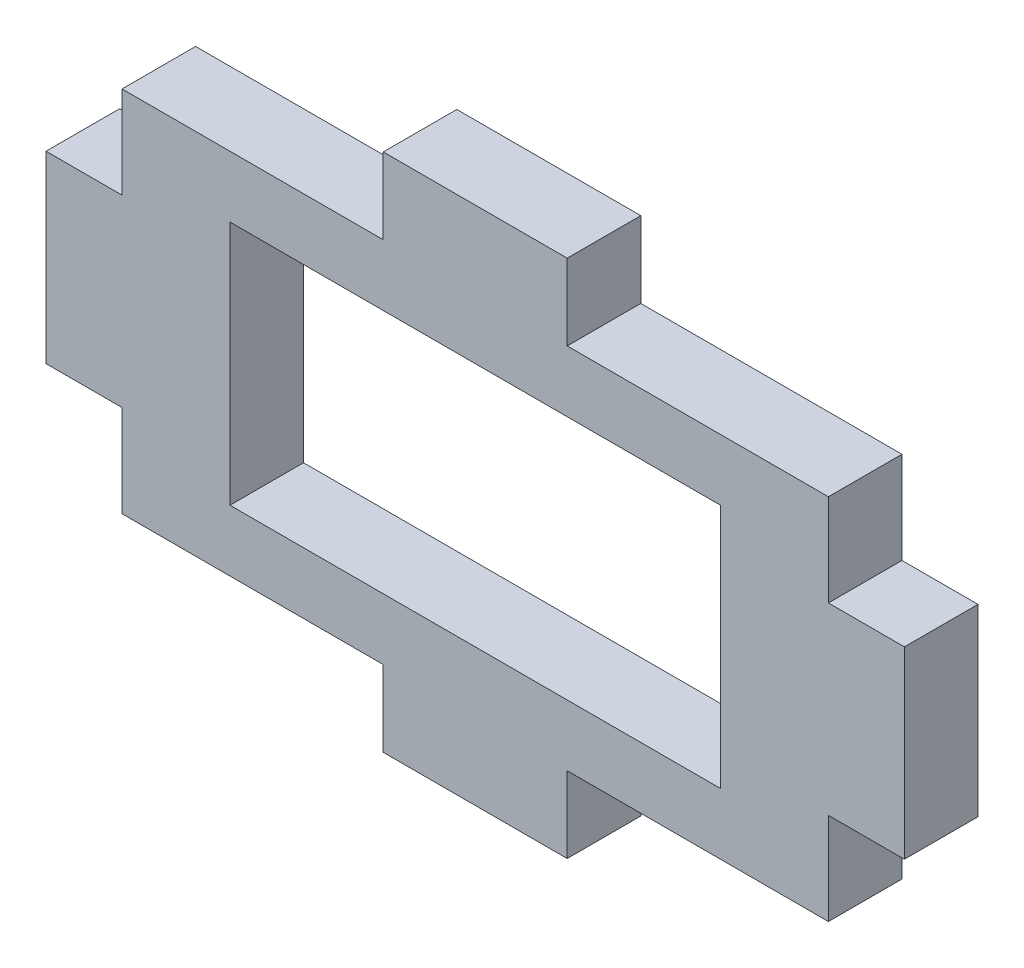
ISO-10303-21;
HEADER;
FILE_DESCRIPTION(('STEP AP214'),'2;1');
FILE_NAME('part.step','',(''),(''),'','','');
FILE_SCHEMA(('AUTOMOTIVE_DESIGN { 1 0 10303 214 1 1 1 1 }'));
ENDSEC;
DATA;
#1=APPLICATION_CONTEXT('core data for automotive mechanical design processes');
#2=APPLICATION_PROTOCOL_DEFINITION('international standard','automotive_design',2000,#1);
#3=PRODUCT_CONTEXT('',#1,'mechanical');
#4=PRODUCT('Part','Part','',(#3));
#5=PRODUCT_RELATED_PRODUCT_CATEGORY('part','',(#4));
#6=PRODUCT_DEFINITION_FORMATION('','',#4);
#7=PRODUCT_DEFINITION_CONTEXT('part definition',#1,'design');
#8=PRODUCT_DEFINITION('design','',#6,#7);
#9=PRODUCT_DEFINITION_SHAPE('','',#8);
#10=(LENGTH_UNIT() NAMED_UNIT(*) SI_UNIT(.MILLI.,.METRE.));
#11=(NAMED_UNIT(*) PLANE_ANGLE_UNIT() SI_UNIT($,.RADIAN.));
#12=(NAMED_UNIT(*) SI_UNIT($,.STERADIAN.) SOLID_ANGLE_UNIT());
#13=UNCERTAINTY_MEASURE_WITH_UNIT(LENGTH_MEASURE(1.E-05),#10,'distance_accuracy_value','');
#14=(GEOMETRIC_REPRESENTATION_CONTEXT(3) GLOBAL_UNCERTAINTY_ASSIGNED_CONTEXT((#13)) GLOBAL_UNIT_ASSIGNED_CONTEXT((#10,
#11,#12)) REPRESENTATION_CONTEXT('',''));
#15=CARTESIAN_POINT('',(0.,0.,0.));
#16=DIRECTION('',(0.,0.,1.));
#17=DIRECTION('',(1.,0.,0.));
#18=AXIS2_PLACEMENT_3D('',#15,#16,#17);
#19=CARTESIAN_POINT('',(28.8,15.,6.));
#20=DIRECTION('',(-1.,0.,0.));
#21=DIRECTION('',(0.,-1.,0.));
#22=AXIS2_PLACEMENT_3D('',#19,#20,#21);
#23=PLANE('',#22);
#24=DIRECTION('',(0.,0.,1.));
#25=VECTOR('',#24,1.);
#26=CARTESIAN_POINT('',(28.8,7.49999999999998,0.));
#27=LINE('',#26,#25);
#28=CARTESIAN_POINT('',(28.8,7.49999999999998,0.));
#29=VERTEX_POINT('',#28);
#30=CARTESIAN_POINT('',(28.8,7.49999999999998,6.));
#31=VERTEX_POINT('',#30);
#32=EDGE_CURVE('E264',#29,#31,#27,.T.);
#33=ORIENTED_EDGE('',*,*,#32,.F.);
#34=DIRECTION('',(0.,1.,0.));
#35=VECTOR('',#34,1.);
#36=CARTESIAN_POINT('',(28.8,15.,0.));
#37=LINE('',#36,#35);
#38=CARTESIAN_POINT('',(28.8,15.,0.));
#39=VERTEX_POINT('',#38);
#40=EDGE_CURVE('E410',#29,#39,#37,.T.);
#41=ORIENTED_EDGE('',*,*,#40,.T.);
#42=DIRECTION('',(0.,0.,-1.));
#43=VECTOR('',#42,1.);
#44=CARTESIAN_POINT('',(28.8,15.,6.));
#45=LINE('',#44,#43);
#46=CARTESIAN_POINT('',(28.8,15.,6.));
#47=VERTEX_POINT('',#46);
#48=EDGE_CURVE('E423',#47,#39,#45,.T.);
#49=ORIENTED_EDGE('',*,*,#48,.F.);
#50=DIRECTION('',(0.,1.,0.));
#51=VECTOR('',#50,1.);
#52=CARTESIAN_POINT('',(28.8,15.,6.));
#53=LINE('',#52,#51);
#54=EDGE_CURVE('E390',#31,#47,#53,.T.);
#55=ORIENTED_EDGE('',*,*,#54,.F.);
#56=EDGE_LOOP('',(#33,#41,#49,#55));
#57=FACE_BOUND('',#56,.T.);
#58=ADVANCED_FACE('F38',(#57),#23,.F.);
#59=CARTESIAN_POINT('',(-28.8,15.,6.));
#60=DIRECTION('',(1.,0.,0.));
#61=DIRECTION('',(0.,1.,0.));
#62=AXIS2_PLACEMENT_3D('',#59,#60,#61);
#63=PLANE('',#62);
#64=DIRECTION('',(0.,0.,1.));
#65=VECTOR('',#64,1.);
#66=CARTESIAN_POINT('',(-28.8,-7.5,0.));
#67=LINE('',#66,#65);
#68=CARTESIAN_POINT('',(-28.8,-7.5,0.));
#69=VERTEX_POINT('',#68);
#70=CARTESIAN_POINT('',(-28.8,-7.5,6.));
#71=VERTEX_POINT('',#70);
#72=EDGE_CURVE('E284',#69,#71,#67,.T.);
#73=ORIENTED_EDGE('',*,*,#72,.F.);
#74=DIRECTION('',(0.,-1.,0.));
#75=VECTOR('',#74,1.);
#76=CARTESIAN_POINT('',(-28.8,15.,0.));
#77=LINE('',#76,#75);
#78=CARTESIAN_POINT('',(-28.8,-15.,0.));
#79=VERTEX_POINT('',#78);
#80=EDGE_CURVE('E370',#69,#79,#77,.T.);
#81=ORIENTED_EDGE('',*,*,#80,.T.);
#82=DIRECTION('',(0.,0.,-1.));
#83=VECTOR('',#82,1.);
#84=CARTESIAN_POINT('',(-28.8,-15.,6.));
#85=LINE('',#84,#83);
#86=CARTESIAN_POINT('',(-28.8,-15.,6.));
#87=VERTEX_POINT('',#86);
#88=EDGE_CURVE('E431',#87,#79,#85,.T.);
#89=ORIENTED_EDGE('',*,*,#88,.F.);
#90=DIRECTION('',(0.,-1.,0.));
#91=VECTOR('',#90,1.);
#92=CARTESIAN_POINT('',(-28.8,15.,6.));
#93=LINE('',#92,#91);
#94=EDGE_CURVE('E385',#71,#87,#93,.T.);
#95=ORIENTED_EDGE('',*,*,#94,.F.);
#96=EDGE_LOOP('',(#73,#81,#89,#95));
#97=FACE_BOUND('',#96,.T.);
#98=ADVANCED_FACE('F462',(#97),#63,.F.);
#99=CARTESIAN_POINT('',(-28.8,-15.,6.));
#100=DIRECTION('',(0.,1.,0.));
#101=DIRECTION('',(0.,0.,1.));
#102=AXIS2_PLACEMENT_3D('',#99,#100,#101);
#103=PLANE('',#102);
#104=DIRECTION('',(0.,0.,1.));
#105=VECTOR('',#104,1.);
#106=CARTESIAN_POINT('',(7.50000000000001,-15.,0.));
#107=LINE('',#106,#105);
#108=CARTESIAN_POINT('',(7.50000000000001,-15.,0.));
#109=VERTEX_POINT('',#108);
#110=CARTESIAN_POINT('',(7.50000000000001,-15.,6.));
#111=VERTEX_POINT('',#110);
#112=EDGE_CURVE('E336',#109,#111,#107,.T.);
#113=ORIENTED_EDGE('',*,*,#112,.F.);
#114=DIRECTION('',(1.,0.,0.));
#115=VECTOR('',#114,1.);
#116=CARTESIAN_POINT('',(-28.8,-15.,0.));
#117=LINE('',#116,#115);
#118=CARTESIAN_POINT('',(28.8,-15.,0.));
#119=VERTEX_POINT('',#118);
#120=EDGE_CURVE('E405',#109,#119,#117,.T.);
#121=ORIENTED_EDGE('',*,*,#120,.T.);
#122=DIRECTION('',(0.,0.,-1.));
#123=VECTOR('',#122,1.);
#124=CARTESIAN_POINT('',(28.8,-15.,6.));
#125=LINE('',#124,#123);
#126=CARTESIAN_POINT('',(28.8,-15.,6.));
#127=VERTEX_POINT('',#126);
#128=EDGE_CURVE('E427',#127,#119,#125,.T.);
#129=ORIENTED_EDGE('',*,*,#128,.F.);
#130=DIRECTION('',(1.,0.,0.));
#131=VECTOR('',#130,1.);
#132=CARTESIAN_POINT('',(-28.8,-15.,6.));
#133=LINE('',#132,#131);
#134=EDGE_CURVE('E384',#111,#127,#133,.T.);
#135=ORIENTED_EDGE('',*,*,#134,.F.);
#136=EDGE_LOOP('',(#113,#121,#129,#135));
#137=FACE_BOUND('',#136,.T.);
#138=ADVANCED_FACE('F469',(#137),#103,.F.);
#139=CARTESIAN_POINT('',(-28.8,15.,6.));
#140=DIRECTION('',(0.,-1.,0.));
#141=DIRECTION('',(0.,0.,-1.));
#142=AXIS2_PLACEMENT_3D('',#139,#140,#141);
#143=PLANE('',#142);
#144=DIRECTION('',(0.,0.,1.));
#145=VECTOR('',#144,1.);
#146=CARTESIAN_POINT('',(-7.5,15.,0.));
#147=LINE('',#146,#145);
#148=CARTESIAN_POINT('',(-7.5,15.,0.));
#149=VERTEX_POINT('',#148);
#150=CARTESIAN_POINT('',(-7.5,15.,6.));
#151=VERTEX_POINT('',#150);
#152=EDGE_CURVE('E356',#149,#151,#147,.T.);
#153=ORIENTED_EDGE('',*,*,#152,.F.);
#154=DIRECTION('',(-1.,0.,0.));
#155=VECTOR('',#154,1.);
#156=CARTESIAN_POINT('',(-28.8,15.,0.));
#157=LINE('',#156,#155);
#158=CARTESIAN_POINT('',(-28.8,15.,0.));
#159=VERTEX_POINT('',#158);
#160=EDGE_CURVE('E415',#149,#159,#157,.T.);
#161=ORIENTED_EDGE('',*,*,#160,.T.);
#162=DIRECTION('',(0.,0.,-1.));
#163=VECTOR('',#162,1.);
#164=CARTESIAN_POINT('',(-28.8,15.,6.));
#165=LINE('',#164,#163);
#166=CARTESIAN_POINT('',(-28.8,15.,6.));
#167=VERTEX_POINT('',#166);
#168=EDGE_CURVE('E400',#167,#159,#165,.T.);
#169=ORIENTED_EDGE('',*,*,#168,.F.);
#170=DIRECTION('',(-1.,0.,0.));
#171=VECTOR('',#170,1.);
#172=CARTESIAN_POINT('',(-28.8,15.,6.));
#173=LINE('',#172,#171);
#174=EDGE_CURVE('E395',#151,#167,#173,.T.);
#175=ORIENTED_EDGE('',*,*,#174,.F.);
#176=EDGE_LOOP('',(#153,#161,#169,#175));
#177=FACE_BOUND('',#176,.T.);
#178=ADVANCED_FACE('F482',(#177),#143,.F.);
#179=CARTESIAN_POINT('',(-28.8000000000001,7.5,0.));
#180=VERTEX_POINT('',#179);
#181=EDGE_CURVE('E401',#159,#180,#77,.T.);
#182=ORIENTED_EDGE('',*,*,#181,.T.);
#183=DIRECTION('',(0.,0.,1.));
#184=VECTOR('',#183,1.);
#185=CARTESIAN_POINT('',(-28.8000000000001,7.5,0.));
#186=LINE('',#185,#184);
#187=CARTESIAN_POINT('',(-28.8,7.5,6.));
#188=VERTEX_POINT('',#187);
#189=EDGE_CURVE('E302',#180,#188,#186,.T.);
#190=ORIENTED_EDGE('',*,*,#189,.T.);
#191=EDGE_CURVE('E380',#167,#188,#93,.T.);
#192=ORIENTED_EDGE('',*,*,#191,.F.);
#193=ORIENTED_EDGE('',*,*,#168,.T.);
#194=EDGE_LOOP('',(#182,#190,#192,#193));
#195=FACE_BOUND('',#194,.T.);
#196=ADVANCED_FACE('F40',(#195),#63,.F.);
#197=CARTESIAN_POINT('',(-7.49999999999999,-15.,0.));
#198=VERTEX_POINT('',#197);
#199=EDGE_CURVE('E406',#79,#198,#117,.T.);
#200=ORIENTED_EDGE('',*,*,#199,.T.);
#201=DIRECTION('',(0.,0.,1.));
#202=VECTOR('',#201,1.);
#203=CARTESIAN_POINT('',(-7.49999999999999,-15.,0.));
#204=LINE('',#203,#202);
#205=CARTESIAN_POINT('',(-7.49999999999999,-15.,6.));
#206=VERTEX_POINT('',#205);
#207=EDGE_CURVE('E331',#198,#206,#204,.T.);
#208=ORIENTED_EDGE('',*,*,#207,.T.);
#209=EDGE_CURVE('E386',#87,#206,#133,.T.);
#210=ORIENTED_EDGE('',*,*,#209,.F.);
#211=ORIENTED_EDGE('',*,*,#88,.T.);
#212=EDGE_LOOP('',(#200,#208,#210,#211));
#213=FACE_BOUND('',#212,.T.);
#214=ADVANCED_FACE('F475',(#213),#103,.F.);
#215=CARTESIAN_POINT('',(28.8000000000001,-7.50000000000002,0.));
#216=VERTEX_POINT('',#215);
#217=EDGE_CURVE('E411',#119,#216,#37,.T.);
#218=ORIENTED_EDGE('',*,*,#217,.T.);
#219=DIRECTION('',(0.,0.,1.));
#220=VECTOR('',#219,1.);
#221=CARTESIAN_POINT('',(28.8000000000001,-7.50000000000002,0.));
#222=LINE('',#221,#220);
#223=CARTESIAN_POINT('',(28.8,-7.50000000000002,6.));
#224=VERTEX_POINT('',#223);
#225=EDGE_CURVE('E259',#216,#224,#222,.T.);
#226=ORIENTED_EDGE('',*,*,#225,.T.);
#227=EDGE_CURVE('E391',#127,#224,#53,.T.);
#228=ORIENTED_EDGE('',*,*,#227,.F.);
#229=ORIENTED_EDGE('',*,*,#128,.T.);
#230=EDGE_LOOP('',(#218,#226,#228,#229));
#231=FACE_BOUND('',#230,.T.);
#232=ADVANCED_FACE('F465',(#231),#23,.F.);
#233=CARTESIAN_POINT('',(7.5,15.,0.));
#234=VERTEX_POINT('',#233);
#235=EDGE_CURVE('E416',#39,#234,#157,.T.);
#236=ORIENTED_EDGE('',*,*,#235,.T.);
#237=DIRECTION('',(0.,0.,1.));
#238=VECTOR('',#237,1.);
#239=CARTESIAN_POINT('',(7.5,15.,0.));
#240=LINE('',#239,#238);
#241=CARTESIAN_POINT('',(7.5,15.,6.));
#242=VERTEX_POINT('',#241);
#243=EDGE_CURVE('E374',#234,#242,#240,.T.);
#244=ORIENTED_EDGE('',*,*,#243,.T.);
#245=EDGE_CURVE('E396',#47,#242,#173,.T.);
#246=ORIENTED_EDGE('',*,*,#245,.F.);
#247=ORIENTED_EDGE('',*,*,#48,.T.);
#248=EDGE_LOOP('',(#236,#244,#246,#247));
#249=FACE_BOUND('',#248,.T.);
#250=ADVANCED_FACE('F474',(#249),#143,.F.);
#251=CARTESIAN_POINT('',(0.,0.,6.));
#252=DIRECTION('',(0.,0.,1.));
#253=DIRECTION('',(1.,0.,0.));
#254=AXIS2_PLACEMENT_3D('',#251,#252,#253);
#255=PLANE('',#254);
#256=DIRECTION('',(0.,-1.,0.));
#257=VECTOR('',#256,1.);
#258=CARTESIAN_POINT('',(-20.,10.,6.));
#259=LINE('',#258,#257);
#260=CARTESIAN_POINT('',(-20.,10.,6.));
#261=VERTEX_POINT('',#260);
#262=CARTESIAN_POINT('',(-20.,-10.,6.));
#263=VERTEX_POINT('',#262);
#264=EDGE_CURVE('E54',#261,#263,#259,.T.);
#265=ORIENTED_EDGE('',*,*,#264,.F.);
#266=DIRECTION('',(-1.,0.,0.));
#267=VECTOR('',#266,1.);
#268=CARTESIAN_POINT('',(-20.,10.,6.));
#269=LINE('',#268,#267);
#270=CARTESIAN_POINT('',(20.,10.,6.));
#271=VERTEX_POINT('',#270);
#272=EDGE_CURVE('E221',#271,#261,#269,.T.);
#273=ORIENTED_EDGE('',*,*,#272,.F.);
#274=DIRECTION('',(0.,1.,0.));
#275=VECTOR('',#274,1.);
#276=CARTESIAN_POINT('',(20.,10.,6.));
#277=LINE('',#276,#275);
#278=CARTESIAN_POINT('',(20.,-9.99999999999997,6.));
#279=VERTEX_POINT('',#278);
#280=EDGE_CURVE('E203',#279,#271,#277,.T.);
#281=ORIENTED_EDGE('',*,*,#280,.F.);
#282=DIRECTION('',(1.,0.,0.));
#283=VECTOR('',#282,1.);
#284=CARTESIAN_POINT('',(-20.,-10.,6.));
#285=LINE('',#284,#283);
#286=EDGE_CURVE('E213',#263,#279,#285,.T.);
#287=ORIENTED_EDGE('',*,*,#286,.F.);
#288=EDGE_LOOP('',(#265,#273,#281,#287));
#289=FACE_BOUND('',#288,.T.);
#290=ORIENTED_EDGE('',*,*,#191,.T.);
#291=DIRECTION('',(-1.,0.,0.));
#292=VECTOR('',#291,1.);
#293=CARTESIAN_POINT('',(-28.8000000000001,7.5,6.));
#294=LINE('',#293,#292);
#295=CARTESIAN_POINT('',(-35.0000000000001,7.49999999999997,6.));
#296=VERTEX_POINT('',#295);
#297=EDGE_CURVE('E288',#188,#296,#294,.T.);
#298=ORIENTED_EDGE('',*,*,#297,.T.);
#299=DIRECTION('',(0.,-1.,0.));
#300=VECTOR('',#299,1.);
#301=CARTESIAN_POINT('',(-35.0000000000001,7.49999999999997,6.));
#302=LINE('',#301,#300);
#303=CARTESIAN_POINT('',(-35.,-7.50000000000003,6.));
#304=VERTEX_POINT('',#303);
#305=EDGE_CURVE('E276',#296,#304,#302,.T.);
#306=ORIENTED_EDGE('',*,*,#305,.T.);
#307=DIRECTION('',(1.,0.,0.));
#308=VECTOR('',#307,1.);
#309=CARTESIAN_POINT('',(-35.,-7.50000000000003,6.));
#310=LINE('',#309,#308);
#311=EDGE_CURVE('E263',#304,#71,#310,.T.);
#312=ORIENTED_EDGE('',*,*,#311,.T.);
#313=ORIENTED_EDGE('',*,*,#94,.T.);
#314=ORIENTED_EDGE('',*,*,#209,.T.);
#315=DIRECTION('',(0.,-1.,0.));
#316=VECTOR('',#315,1.);
#317=CARTESIAN_POINT('',(-7.49999999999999,-15.,6.));
#318=LINE('',#317,#316);
#319=CARTESIAN_POINT('',(-7.49999999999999,-21.2,6.));
#320=VERTEX_POINT('',#319);
#321=EDGE_CURVE('E298',#206,#320,#318,.T.);
#322=ORIENTED_EDGE('',*,*,#321,.T.);
#323=DIRECTION('',(1.,0.,0.));
#324=VECTOR('',#323,1.);
#325=CARTESIAN_POINT('',(-7.49999999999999,-21.2,6.));
#326=LINE('',#325,#324);
#327=CARTESIAN_POINT('',(7.50000000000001,-21.2,6.));
#328=VERTEX_POINT('',#327);
#329=EDGE_CURVE('E324',#320,#328,#326,.T.);
#330=ORIENTED_EDGE('',*,*,#329,.T.);
#331=DIRECTION('',(0.,1.,0.));
#332=VECTOR('',#331,1.);
#333=CARTESIAN_POINT('',(7.50000000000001,-21.2,6.));
#334=LINE('',#333,#332);
#335=EDGE_CURVE('E313',#328,#111,#334,.T.);
#336=ORIENTED_EDGE('',*,*,#335,.T.);
#337=ORIENTED_EDGE('',*,*,#134,.T.);
#338=ORIENTED_EDGE('',*,*,#227,.T.);
#339=DIRECTION('',(1.,0.,0.));
#340=VECTOR('',#339,1.);
#341=CARTESIAN_POINT('',(28.8000000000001,-7.50000000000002,6.));
#342=LINE('',#341,#340);
#343=CARTESIAN_POINT('',(35.0000000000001,-7.5,6.));
#344=VERTEX_POINT('',#343);
#345=EDGE_CURVE('E231',#224,#344,#342,.T.);
#346=ORIENTED_EDGE('',*,*,#345,.T.);
#347=DIRECTION('',(0.,1.,0.));
#348=VECTOR('',#347,1.);
#349=CARTESIAN_POINT('',(35.0000000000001,-7.5,6.));
#350=LINE('',#349,#348);
#351=CARTESIAN_POINT('',(35.,7.5,6.));
#352=VERTEX_POINT('',#351);
#353=EDGE_CURVE('E252',#344,#352,#350,.T.);
#354=ORIENTED_EDGE('',*,*,#353,.T.);
#355=DIRECTION('',(-1.,0.,0.));
#356=VECTOR('',#355,1.);
#357=CARTESIAN_POINT('',(35.,7.5,6.));
#358=LINE('',#357,#356);
#359=EDGE_CURVE('E241',#352,#31,#358,.T.);
#360=ORIENTED_EDGE('',*,*,#359,.T.);
#361=ORIENTED_EDGE('',*,*,#54,.T.);
#362=ORIENTED_EDGE('',*,*,#245,.T.);
#363=DIRECTION('',(0.,1.,0.));
#364=VECTOR('',#363,1.);
#365=CARTESIAN_POINT('',(7.5,15.,6.));
#366=LINE('',#365,#364);
#367=CARTESIAN_POINT('',(7.5,21.2,6.));
#368=VERTEX_POINT('',#367);
#369=EDGE_CURVE('E360',#242,#368,#366,.T.);
#370=ORIENTED_EDGE('',*,*,#369,.T.);
#371=DIRECTION('',(-1.,0.,0.));
#372=VECTOR('',#371,1.);
#373=CARTESIAN_POINT('',(7.5,21.2,6.));
#374=LINE('',#373,#372);
#375=CARTESIAN_POINT('',(-7.5,21.2,6.));
#376=VERTEX_POINT('',#375);
#377=EDGE_CURVE('E348',#368,#376,#374,.T.);
#378=ORIENTED_EDGE('',*,*,#377,.T.);
#379=DIRECTION('',(0.,-1.,0.));
#380=VECTOR('',#379,1.);
#381=CARTESIAN_POINT('',(-7.5,21.2,6.));
#382=LINE('',#381,#380);
#383=EDGE_CURVE('E335',#376,#151,#382,.T.);
#384=ORIENTED_EDGE('',*,*,#383,.T.);
#385=ORIENTED_EDGE('',*,*,#174,.T.);
#386=EDGE_LOOP('',(#290,#298,#306,#312,#313,#314,#322,#330,#336,#337,#338,#346,#354,#360,#361,
#362,#370,#378,#384,#385));
#387=FACE_BOUND('',#386,.T.);
#388=ADVANCED_FACE('F218',(#289,#387),#255,.T.);
#389=CARTESIAN_POINT('',(0.,0.,0.));
#390=DIRECTION('',(0.,0.,1.));
#391=DIRECTION('',(1.,0.,0.));
#392=AXIS2_PLACEMENT_3D('',#389,#390,#391);
#393=PLANE('',#392);
#394=DIRECTION('',(-1.,0.,0.));
#395=VECTOR('',#394,1.);
#396=CARTESIAN_POINT('',(0.,10.,0.));
#397=LINE('',#396,#395);
#398=CARTESIAN_POINT('',(20.,10.,0.));
#399=VERTEX_POINT('',#398);
#400=CARTESIAN_POINT('',(-20.,10.,0.));
#401=VERTEX_POINT('',#400);
#402=EDGE_CURVE('E47',#399,#401,#397,.T.);
#403=ORIENTED_EDGE('',*,*,#402,.T.);
#404=DIRECTION('',(0.,-1.,0.));
#405=VECTOR('',#404,1.);
#406=CARTESIAN_POINT('',(-20.,0.,0.));
#407=LINE('',#406,#405);
#408=CARTESIAN_POINT('',(-20.,-10.,0.));
#409=VERTEX_POINT('',#408);
#410=EDGE_CURVE('E11',#401,#409,#407,.T.);
#411=ORIENTED_EDGE('',*,*,#410,.T.);
#412=DIRECTION('',(1.,0.,0.));
#413=VECTOR('',#412,1.);
#414=CARTESIAN_POINT('',(0.,-9.99999999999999,0.));
#415=LINE('',#414,#413);
#416=CARTESIAN_POINT('',(20.,-9.99999999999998,0.));
#417=VERTEX_POINT('',#416);
#418=EDGE_CURVE('E435',#409,#417,#415,.T.);
#419=ORIENTED_EDGE('',*,*,#418,.T.);
#420=DIRECTION('',(0.,1.,0.));
#421=VECTOR('',#420,1.);
#422=CARTESIAN_POINT('',(20.,0.,0.));
#423=LINE('',#422,#421);
#424=EDGE_CURVE('E206',#417,#399,#423,.T.);
#425=ORIENTED_EDGE('',*,*,#424,.T.);
#426=EDGE_LOOP('',(#403,#411,#419,#425));
#427=FACE_BOUND('',#426,.T.);
#428=ORIENTED_EDGE('',*,*,#181,.F.);
#429=ORIENTED_EDGE('',*,*,#160,.F.);
#430=DIRECTION('',(0.,-1.,0.));
#431=VECTOR('',#430,1.);
#432=CARTESIAN_POINT('',(-7.5,21.2,0.));
#433=LINE('',#432,#431);
#434=CARTESIAN_POINT('',(-7.5,21.2,0.));
#435=VERTEX_POINT('',#434);
#436=EDGE_CURVE('E344',#435,#149,#433,.T.);
#437=ORIENTED_EDGE('',*,*,#436,.F.);
#438=DIRECTION('',(-1.,0.,0.));
#439=VECTOR('',#438,1.);
#440=CARTESIAN_POINT('',(7.5,21.2,0.));
#441=LINE('',#440,#439);
#442=CARTESIAN_POINT('',(7.5,21.2,0.));
#443=VERTEX_POINT('',#442);
#444=EDGE_CURVE('E352',#443,#435,#441,.T.);
#445=ORIENTED_EDGE('',*,*,#444,.F.);
#446=DIRECTION('',(0.,1.,0.));
#447=VECTOR('',#446,1.);
#448=CARTESIAN_POINT('',(7.5,15.,0.));
#449=LINE('',#448,#447);
#450=EDGE_CURVE('E347',#234,#443,#449,.T.);
#451=ORIENTED_EDGE('',*,*,#450,.F.);
#452=ORIENTED_EDGE('',*,*,#235,.F.);
#453=ORIENTED_EDGE('',*,*,#40,.F.);
#454=DIRECTION('',(-1.,0.,0.));
#455=VECTOR('',#454,1.);
#456=CARTESIAN_POINT('',(35.,7.5,0.));
#457=LINE('',#456,#455);
#458=CARTESIAN_POINT('',(35.,7.5,0.));
#459=VERTEX_POINT('',#458);
#460=EDGE_CURVE('E245',#459,#29,#457,.T.);
#461=ORIENTED_EDGE('',*,*,#460,.F.);
#462=DIRECTION('',(0.,1.,0.));
#463=VECTOR('',#462,1.);
#464=CARTESIAN_POINT('',(35.0000000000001,-7.5,0.));
#465=LINE('',#464,#463);
#466=CARTESIAN_POINT('',(35.0000000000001,-7.5,0.));
#467=VERTEX_POINT('',#466);
#468=EDGE_CURVE('E240',#467,#459,#465,.T.);
#469=ORIENTED_EDGE('',*,*,#468,.F.);
#470=DIRECTION('',(1.,0.,0.));
#471=VECTOR('',#470,1.);
#472=CARTESIAN_POINT('',(28.8000000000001,-7.50000000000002,0.));
#473=LINE('',#472,#471);
#474=EDGE_CURVE('E236',#216,#467,#473,.T.);
#475=ORIENTED_EDGE('',*,*,#474,.F.);
#476=ORIENTED_EDGE('',*,*,#217,.F.);
#477=ORIENTED_EDGE('',*,*,#120,.F.);
#478=DIRECTION('',(0.,1.,0.));
#479=VECTOR('',#478,1.);
#480=CARTESIAN_POINT('',(7.50000000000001,-21.2,0.));
#481=LINE('',#480,#479);
#482=CARTESIAN_POINT('',(7.50000000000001,-21.2,0.));
#483=VERTEX_POINT('',#482);
#484=EDGE_CURVE('E317',#483,#109,#481,.T.);
#485=ORIENTED_EDGE('',*,*,#484,.F.);
#486=DIRECTION('',(1.,0.,0.));
#487=VECTOR('',#486,1.);
#488=CARTESIAN_POINT('',(-7.49999999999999,-21.2,0.));
#489=LINE('',#488,#487);
#490=CARTESIAN_POINT('',(-7.49999999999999,-21.2,0.));
#491=VERTEX_POINT('',#490);
#492=EDGE_CURVE('E312',#491,#483,#489,.T.);
#493=ORIENTED_EDGE('',*,*,#492,.F.);
#494=DIRECTION('',(0.,-1.,0.));
#495=VECTOR('',#494,1.);
#496=CARTESIAN_POINT('',(-7.49999999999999,-15.,0.));
#497=LINE('',#496,#495);
#498=EDGE_CURVE('E308',#198,#491,#497,.T.);
#499=ORIENTED_EDGE('',*,*,#498,.F.);
#500=ORIENTED_EDGE('',*,*,#199,.F.);
#501=ORIENTED_EDGE('',*,*,#80,.F.);
#502=DIRECTION('',(1.,0.,0.));
#503=VECTOR('',#502,1.);
#504=CARTESIAN_POINT('',(-35.,-7.50000000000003,0.));
#505=LINE('',#504,#503);
#506=CARTESIAN_POINT('',(-35.,-7.50000000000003,0.));
#507=VERTEX_POINT('',#506);
#508=EDGE_CURVE('E272',#507,#69,#505,.T.);
#509=ORIENTED_EDGE('',*,*,#508,.F.);
#510=DIRECTION('',(0.,-1.,0.));
#511=VECTOR('',#510,1.);
#512=CARTESIAN_POINT('',(-35.0000000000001,7.49999999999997,0.));
#513=LINE('',#512,#511);
#514=CARTESIAN_POINT('',(-35.0000000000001,7.49999999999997,0.));
#515=VERTEX_POINT('',#514);
#516=EDGE_CURVE('E280',#515,#507,#513,.T.);
#517=ORIENTED_EDGE('',*,*,#516,.F.);
#518=DIRECTION('',(-1.,0.,0.));
#519=VECTOR('',#518,1.);
#520=CARTESIAN_POINT('',(-28.8000000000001,7.5,0.));
#521=LINE('',#520,#519);
#522=EDGE_CURVE('E275',#180,#515,#521,.T.);
#523=ORIENTED_EDGE('',*,*,#522,.F.);
#524=EDGE_LOOP('',(#428,#429,#437,#445,#451,#452,#453,#461,#469,#475,#476,#477,#485,#493,#499,
#500,#501,#509,#517,#523));
#525=FACE_BOUND('',#524,.T.);
#526=ADVANCED_FACE('F442',(#427,#525),#393,.F.);
#527=CARTESIAN_POINT('',(-7.5,21.2,0.));
#528=DIRECTION('',(-1.,0.,0.));
#529=DIRECTION('',(0.,0.,1.));
#530=AXIS2_PLACEMENT_3D('',#527,#528,#529);
#531=PLANE('',#530);
#532=ORIENTED_EDGE('',*,*,#383,.F.);
#533=DIRECTION('',(0.,0.,1.));
#534=VECTOR('',#533,1.);
#535=CARTESIAN_POINT('',(-7.5,21.2,0.));
#536=LINE('',#535,#534);
#537=EDGE_CURVE('E367',#435,#376,#536,.T.);
#538=ORIENTED_EDGE('',*,*,#537,.F.);
#539=ORIENTED_EDGE('',*,*,#436,.T.);
#540=ORIENTED_EDGE('',*,*,#152,.T.);
#541=EDGE_LOOP('',(#532,#538,#539,#540));
#542=FACE_BOUND('',#541,.T.);
#543=ADVANCED_FACE('F570',(#542),#531,.T.);
#544=CARTESIAN_POINT('',(7.5,21.2,0.));
#545=DIRECTION('',(0.,1.,0.));
#546=DIRECTION('',(0.,0.,1.));
#547=AXIS2_PLACEMENT_3D('',#544,#545,#546);
#548=PLANE('',#547);
#549=ORIENTED_EDGE('',*,*,#377,.F.);
#550=DIRECTION('',(0.,0.,1.));
#551=VECTOR('',#550,1.);
#552=CARTESIAN_POINT('',(7.5,21.2,0.));
#553=LINE('',#552,#551);
#554=EDGE_CURVE('E371',#443,#368,#553,.T.);
#555=ORIENTED_EDGE('',*,*,#554,.F.);
#556=ORIENTED_EDGE('',*,*,#444,.T.);
#557=ORIENTED_EDGE('',*,*,#537,.T.);
#558=EDGE_LOOP('',(#549,#555,#556,#557));
#559=FACE_BOUND('',#558,.T.);
#560=ADVANCED_FACE('F567',(#559),#548,.T.);
#561=CARTESIAN_POINT('',(7.5,15.,0.));
#562=DIRECTION('',(1.,0.,0.));
#563=DIRECTION('',(0.,0.,-1.));
#564=AXIS2_PLACEMENT_3D('',#561,#562,#563);
#565=PLANE('',#564);
#566=ORIENTED_EDGE('',*,*,#369,.F.);
#567=ORIENTED_EDGE('',*,*,#243,.F.);
#568=ORIENTED_EDGE('',*,*,#450,.T.);
#569=ORIENTED_EDGE('',*,*,#554,.T.);
#570=EDGE_LOOP('',(#566,#567,#568,#569));
#571=FACE_BOUND('',#570,.T.);
#572=ADVANCED_FACE('F525',(#571),#565,.T.);
#573=CARTESIAN_POINT('',(-7.49999999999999,-15.,0.));
#574=DIRECTION('',(-1.,0.,0.));
#575=DIRECTION('',(0.,0.,1.));
#576=AXIS2_PLACEMENT_3D('',#573,#574,#575);
#577=PLANE('',#576);
#578=ORIENTED_EDGE('',*,*,#321,.F.);
#579=ORIENTED_EDGE('',*,*,#207,.F.);
#580=ORIENTED_EDGE('',*,*,#498,.T.);
#581=DIRECTION('',(0.,0.,1.));
#582=VECTOR('',#581,1.);
#583=CARTESIAN_POINT('',(-7.49999999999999,-21.2,0.));
#584=LINE('',#583,#582);
#585=EDGE_CURVE('E320',#491,#320,#584,.T.);
#586=ORIENTED_EDGE('',*,*,#585,.T.);
#587=EDGE_LOOP('',(#578,#579,#580,#586));
#588=FACE_BOUND('',#587,.T.);
#589=ADVANCED_FACE('F561',(#588),#577,.T.);
#590=CARTESIAN_POINT('',(7.50000000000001,-21.2,0.));
#591=DIRECTION('',(1.,0.,0.));
#592=DIRECTION('',(0.,0.,-1.));
#593=AXIS2_PLACEMENT_3D('',#590,#591,#592);
#594=PLANE('',#593);
#595=ORIENTED_EDGE('',*,*,#335,.F.);
#596=DIRECTION('',(0.,0.,1.));
#597=VECTOR('',#596,1.);
#598=CARTESIAN_POINT('',(7.50000000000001,-21.2,0.));
#599=LINE('',#598,#597);
#600=EDGE_CURVE('E339',#483,#328,#599,.T.);
#601=ORIENTED_EDGE('',*,*,#600,.F.);
#602=ORIENTED_EDGE('',*,*,#484,.T.);
#603=ORIENTED_EDGE('',*,*,#112,.T.);
#604=EDGE_LOOP('',(#595,#601,#602,#603));
#605=FACE_BOUND('',#604,.T.);
#606=ADVANCED_FACE('F555',(#605),#594,.T.);
#607=CARTESIAN_POINT('',(-7.49999999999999,-21.2,0.));
#608=DIRECTION('',(0.,-1.,0.));
#609=DIRECTION('',(0.,0.,-1.));
#610=AXIS2_PLACEMENT_3D('',#607,#608,#609);
#611=PLANE('',#610);
#612=ORIENTED_EDGE('',*,*,#329,.F.);
#613=ORIENTED_EDGE('',*,*,#585,.F.);
#614=ORIENTED_EDGE('',*,*,#492,.T.);
#615=ORIENTED_EDGE('',*,*,#600,.T.);
#616=EDGE_LOOP('',(#612,#613,#614,#615));
#617=FACE_BOUND('',#616,.T.);
#618=ADVANCED_FACE('F548',(#617),#611,.T.);
#619=CARTESIAN_POINT('',(-35.,-7.50000000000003,0.));
#620=DIRECTION('',(0.,-1.,0.));
#621=DIRECTION('',(1.,0.,0.));
#622=AXIS2_PLACEMENT_3D('',#619,#620,#621);
#623=PLANE('',#622);
#624=ORIENTED_EDGE('',*,*,#311,.F.);
#625=DIRECTION('',(0.,0.,1.));
#626=VECTOR('',#625,1.);
#627=CARTESIAN_POINT('',(-35.,-7.50000000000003,0.));
#628=LINE('',#627,#626);
#629=EDGE_CURVE('E295',#507,#304,#628,.T.);
#630=ORIENTED_EDGE('',*,*,#629,.F.);
#631=ORIENTED_EDGE('',*,*,#508,.T.);
#632=ORIENTED_EDGE('',*,*,#72,.T.);
#633=EDGE_LOOP('',(#624,#630,#631,#632));
#634=FACE_BOUND('',#633,.T.);
#635=ADVANCED_FACE('F546',(#634),#623,.T.);
#636=CARTESIAN_POINT('',(-35.0000000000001,7.49999999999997,0.));
#637=DIRECTION('',(-1.,0.,0.));
#638=DIRECTION('',(0.,-1.,0.));
#639=AXIS2_PLACEMENT_3D('',#636,#637,#638);
#640=PLANE('',#639);
#641=ORIENTED_EDGE('',*,*,#305,.F.);
#642=DIRECTION('',(0.,0.,1.));
#643=VECTOR('',#642,1.);
#644=CARTESIAN_POINT('',(-35.0000000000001,7.49999999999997,0.));
#645=LINE('',#644,#643);
#646=EDGE_CURVE('E299',#515,#296,#645,.T.);
#647=ORIENTED_EDGE('',*,*,#646,.F.);
#648=ORIENTED_EDGE('',*,*,#516,.T.);
#649=ORIENTED_EDGE('',*,*,#629,.T.);
#650=EDGE_LOOP('',(#641,#647,#648,#649));
#651=FACE_BOUND('',#650,.T.);
#652=ADVANCED_FACE('F544',(#651),#640,.T.);
#653=CARTESIAN_POINT('',(-28.8000000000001,7.5,0.));
#654=DIRECTION('',(0.,1.,0.));
#655=DIRECTION('',(-1.,0.,0.));
#656=AXIS2_PLACEMENT_3D('',#653,#654,#655);
#657=PLANE('',#656);
#658=ORIENTED_EDGE('',*,*,#297,.F.);
#659=ORIENTED_EDGE('',*,*,#189,.F.);
#660=ORIENTED_EDGE('',*,*,#522,.T.);
#661=ORIENTED_EDGE('',*,*,#646,.T.);
#662=EDGE_LOOP('',(#658,#659,#660,#661));
#663=FACE_BOUND('',#662,.T.);
#664=ADVANCED_FACE('F540',(#663),#657,.T.);
#665=CARTESIAN_POINT('',(28.8000000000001,-7.50000000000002,0.));
#666=DIRECTION('',(0.,-1.,0.));
#667=DIRECTION('',(1.,0.,0.));
#668=AXIS2_PLACEMENT_3D('',#665,#666,#667);
#669=PLANE('',#668);
#670=ORIENTED_EDGE('',*,*,#345,.F.);
#671=ORIENTED_EDGE('',*,*,#225,.F.);
#672=ORIENTED_EDGE('',*,*,#474,.T.);
#673=DIRECTION('',(0.,0.,1.));
#674=VECTOR('',#673,1.);
#675=CARTESIAN_POINT('',(35.0000000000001,-7.5,0.));
#676=LINE('',#675,#674);
#677=EDGE_CURVE('E248',#467,#344,#676,.T.);
#678=ORIENTED_EDGE('',*,*,#677,.T.);
#679=EDGE_LOOP('',(#670,#671,#672,#678));
#680=FACE_BOUND('',#679,.T.);
#681=ADVANCED_FACE('F494',(#680),#669,.T.);
#682=CARTESIAN_POINT('',(35.,7.5,0.));
#683=DIRECTION('',(0.,1.,0.));
#684=DIRECTION('',(-1.,0.,0.));
#685=AXIS2_PLACEMENT_3D('',#682,#683,#684);
#686=PLANE('',#685);
#687=ORIENTED_EDGE('',*,*,#359,.F.);
#688=DIRECTION('',(0.,0.,1.));
#689=VECTOR('',#688,1.);
#690=CARTESIAN_POINT('',(35.,7.5,0.));
#691=LINE('',#690,#689);
#692=EDGE_CURVE('E267',#459,#352,#691,.T.);
#693=ORIENTED_EDGE('',*,*,#692,.F.);
#694=ORIENTED_EDGE('',*,*,#460,.T.);
#695=ORIENTED_EDGE('',*,*,#32,.T.);
#696=EDGE_LOOP('',(#687,#693,#694,#695));
#697=FACE_BOUND('',#696,.T.);
#698=ADVANCED_FACE('F456',(#697),#686,.T.);
#699=CARTESIAN_POINT('',(35.0000000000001,-7.5,0.));
#700=DIRECTION('',(1.,0.,0.));
#701=DIRECTION('',(0.,1.,0.));
#702=AXIS2_PLACEMENT_3D('',#699,#700,#701);
#703=PLANE('',#702);
#704=ORIENTED_EDGE('',*,*,#353,.F.);
#705=ORIENTED_EDGE('',*,*,#677,.F.);
#706=ORIENTED_EDGE('',*,*,#468,.T.);
#707=ORIENTED_EDGE('',*,*,#692,.T.);
#708=EDGE_LOOP('',(#704,#705,#706,#707));
#709=FACE_BOUND('',#708,.T.);
#710=ADVANCED_FACE('F449',(#709),#703,.T.);
#711=CARTESIAN_POINT('',(-20.,10.,-4.));
#712=DIRECTION('',(-1.,0.,0.));
#713=DIRECTION('',(0.,-1.,0.));
#714=AXIS2_PLACEMENT_3D('',#711,#712,#713);
#715=PLANE('',#714);
#716=DIRECTION('',(0.,0.,1.));
#717=VECTOR('',#716,1.);
#718=CARTESIAN_POINT('',(-20.,10.,-4.));
#719=LINE('',#718,#717);
#720=EDGE_CURVE('E228',#401,#261,#719,.T.);
#721=ORIENTED_EDGE('',*,*,#720,.T.);
#722=ORIENTED_EDGE('',*,*,#264,.T.);
#723=DIRECTION('',(0.,0.,1.));
#724=VECTOR('',#723,1.);
#725=CARTESIAN_POINT('',(-20.,-10.,-4.));
#726=LINE('',#725,#724);
#727=EDGE_CURVE('E210',#409,#263,#726,.T.);
#728=ORIENTED_EDGE('',*,*,#727,.F.);
#729=ORIENTED_EDGE('',*,*,#410,.F.);
#730=EDGE_LOOP('',(#721,#722,#728,#729));
#731=FACE_BOUND('',#730,.T.);
#732=ADVANCED_FACE('F447',(#731),#715,.F.);
#733=CARTESIAN_POINT('',(-20.,10.,-4.));
#734=DIRECTION('',(0.,1.,0.));
#735=DIRECTION('',(-1.,0.,0.));
#736=AXIS2_PLACEMENT_3D('',#733,#734,#735);
#737=PLANE('',#736);
#738=DIRECTION('',(0.,0.,1.));
#739=VECTOR('',#738,1.);
#740=CARTESIAN_POINT('',(20.,10.,-4.));
#741=LINE('',#740,#739);
#742=EDGE_CURVE('E209',#399,#271,#741,.T.);
#743=ORIENTED_EDGE('',*,*,#742,.T.);
#744=ORIENTED_EDGE('',*,*,#272,.T.);
#745=ORIENTED_EDGE('',*,*,#720,.F.);
#746=ORIENTED_EDGE('',*,*,#402,.F.);
#747=EDGE_LOOP('',(#743,#744,#745,#746));
#748=FACE_BOUND('',#747,.T.);
#749=ADVANCED_FACE('F446',(#748),#737,.F.);
#750=CARTESIAN_POINT('',(20.,10.,-4.));
#751=DIRECTION('',(1.,0.,0.));
#752=DIRECTION('',(0.,1.,0.));
#753=AXIS2_PLACEMENT_3D('',#750,#751,#752);
#754=PLANE('',#753);
#755=DIRECTION('',(0.,0.,1.));
#756=VECTOR('',#755,1.);
#757=CARTESIAN_POINT('',(20.,-9.99999999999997,-4.));
#758=LINE('',#757,#756);
#759=EDGE_CURVE('E62',#417,#279,#758,.T.);
#760=ORIENTED_EDGE('',*,*,#759,.T.);
#761=ORIENTED_EDGE('',*,*,#280,.T.);
#762=ORIENTED_EDGE('',*,*,#742,.F.);
#763=ORIENTED_EDGE('',*,*,#424,.F.);
#764=EDGE_LOOP('',(#760,#761,#762,#763));
#765=FACE_BOUND('',#764,.T.);
#766=ADVANCED_FACE('F200',(#765),#754,.F.);
#767=CARTESIAN_POINT('',(-20.,-10.,-4.));
#768=DIRECTION('',(0.,-1.,0.));
#769=DIRECTION('',(1.,0.,0.));
#770=AXIS2_PLACEMENT_3D('',#767,#768,#769);
#771=PLANE('',#770);
#772=ORIENTED_EDGE('',*,*,#727,.T.);
#773=ORIENTED_EDGE('',*,*,#286,.T.);
#774=ORIENTED_EDGE('',*,*,#759,.F.);
#775=ORIENTED_EDGE('',*,*,#418,.F.);
#776=EDGE_LOOP('',(#772,#773,#774,#775));
#777=FACE_BOUND('',#776,.T.);
#778=ADVANCED_FACE('F214',(#777),#771,.F.);
#779=CLOSED_SHELL('',(#58,#98,#138,#178,#196,#214,#232,#250,#388,#526,#543,#560,#572,#589,#606,
#618,#635,#652,#664,#681,#698,#710,#732,#749,#766,#778));
#780=MANIFOLD_SOLID_BREP('B2',#779);
#781=ADVANCED_BREP_SHAPE_REPRESENTATION('',(#18,#780),#14);
#782=SHAPE_DEFINITION_REPRESENTATION(#9,#781);
ENDSEC;
END-ISO-10303-21;
